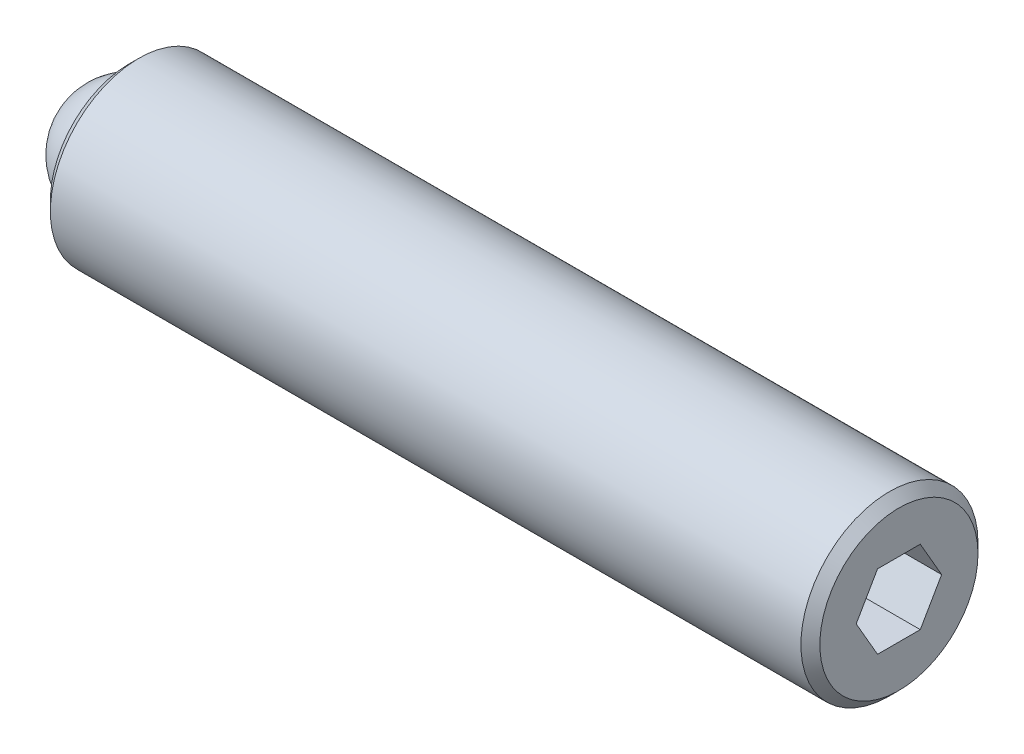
ISO-10303-21;
HEADER;
FILE_DESCRIPTION(('STEP AP214'),'2;1');
FILE_NAME('part.step','',(''),(''),'','','');
FILE_SCHEMA(('AUTOMOTIVE_DESIGN { 1 0 10303 214 1 1 1 1 }'));
ENDSEC;
DATA;
#1=APPLICATION_CONTEXT('core data for automotive mechanical design processes');
#2=APPLICATION_PROTOCOL_DEFINITION('international standard','automotive_design',2000,#1);
#3=PRODUCT_CONTEXT('',#1,'mechanical');
#4=PRODUCT('Part','Part','',(#3));
#5=PRODUCT_RELATED_PRODUCT_CATEGORY('part','',(#4));
#6=PRODUCT_DEFINITION_FORMATION('','',#4);
#7=PRODUCT_DEFINITION_CONTEXT('part definition',#1,'design');
#8=PRODUCT_DEFINITION('design','',#6,#7);
#9=PRODUCT_DEFINITION_SHAPE('','',#8);
#10=(LENGTH_UNIT() NAMED_UNIT(*) SI_UNIT(.MILLI.,.METRE.));
#11=(NAMED_UNIT(*) PLANE_ANGLE_UNIT() SI_UNIT($,.RADIAN.));
#12=(NAMED_UNIT(*) SI_UNIT($,.STERADIAN.) SOLID_ANGLE_UNIT());
#13=UNCERTAINTY_MEASURE_WITH_UNIT(LENGTH_MEASURE(1.E-05),#10,'distance_accuracy_value','');
#14=(GEOMETRIC_REPRESENTATION_CONTEXT(3) GLOBAL_UNCERTAINTY_ASSIGNED_CONTEXT((#13)) GLOBAL_UNIT_ASSIGNED_CONTEXT((#10,
#11,#12)) REPRESENTATION_CONTEXT('',''));
#15=CARTESIAN_POINT('',(0.,0.,0.));
#16=DIRECTION('',(0.,0.,1.));
#17=DIRECTION('',(1.,0.,0.));
#18=AXIS2_PLACEMENT_3D('',#15,#16,#17);
#19=CARTESIAN_POINT('',(0.,0.,0.));
#20=DIRECTION('',(0.,-1.,0.));
#21=DIRECTION('',(0.,0.,1.));
#22=AXIS2_PLACEMENT_3D('',#19,#20,#21);
#23=SPHERICAL_SURFACE('',#22,1.5875);
#24=CARTESIAN_POINT('',(0.,-1.5875,0.));
#25=VERTEX_POINT('',#24);
#26=VERTEX_LOOP('',#25);
#27=FACE_BOUND('',#26,.T.);
#28=ADVANCED_FACE('F41',(#27),#23,.T.);
#29=CLOSED_SHELL('',(#28));
#30=MANIFOLD_SOLID_BREP('B2',#29);
#31=CARTESIAN_POINT('',(20.6375,0.,0.));
#32=DIRECTION('',(-1.,0.,0.));
#33=DIRECTION('',(0.,0.,1.));
#34=AXIS2_PLACEMENT_3D('',#31,#32,#33);
#35=CYLINDRICAL_SURFACE('',#34,2.3749);
#36=CARTESIAN_POINT('',(20.3835,0.,0.));
#37=DIRECTION('',(1.,0.,0.));
#38=DIRECTION('',(0.,0.,-1.));
#39=AXIS2_PLACEMENT_3D('',#36,#37,#38);
#40=CIRCLE('',#39,2.3749);
#41=CARTESIAN_POINT('',(20.3835,0.,-2.3749));
#42=VERTEX_POINT('',#41);
#43=EDGE_CURVE('E39',#42,#42,#40,.F.);
#44=ORIENTED_EDGE('',*,*,#43,.T.);
#45=EDGE_LOOP('',(#44));
#46=FACE_BOUND('',#45,.T.);
#47=CARTESIAN_POINT('',(0.254000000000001,0.,0.));
#48=DIRECTION('',(1.,0.,0.));
#49=DIRECTION('',(0.,0.,-1.));
#50=AXIS2_PLACEMENT_3D('',#47,#48,#49);
#51=CIRCLE('',#50,2.3749);
#52=CARTESIAN_POINT('',(0.254000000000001,0.,-2.3749));
#53=VERTEX_POINT('',#52);
#54=EDGE_CURVE('E157',#53,#53,#51,.T.);
#55=ORIENTED_EDGE('',*,*,#54,.T.);
#56=EDGE_LOOP('',(#55));
#57=FACE_BOUND('',#56,.T.);
#58=ADVANCED_FACE('F54',(#46,#57),#35,.T.);
#59=CARTESIAN_POINT('',(20.6375,0.,0.));
#60=DIRECTION('',(1.,0.,0.));
#61=DIRECTION('',(0.,0.,-1.));
#62=AXIS2_PLACEMENT_3D('',#59,#60,#61);
#63=PLANE('',#62);
#64=DIRECTION('',(0.,0.866025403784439,-0.5));
#65=VECTOR('',#64,1.);
#66=CARTESIAN_POINT('',(20.6375,-0.992187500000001,-0.572839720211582));
#67=LINE('',#66,#65);
#68=CARTESIAN_POINT('',(20.6375,-0.992187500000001,-0.572839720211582));
#69=VERTEX_POINT('',#68);
#70=CARTESIAN_POINT('',(20.6375,0.,-1.14567944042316));
#71=VERTEX_POINT('',#70);
#72=EDGE_CURVE('E69',#69,#71,#67,.T.);
#73=ORIENTED_EDGE('',*,*,#72,.F.);
#74=DIRECTION('',(0.,0.,-1.));
#75=VECTOR('',#74,1.);
#76=CARTESIAN_POINT('',(20.6375,-0.992187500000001,0.572839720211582));
#77=LINE('',#76,#75);
#78=CARTESIAN_POINT('',(20.6375,-0.992187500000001,0.572839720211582));
#79=VERTEX_POINT('',#78);
#80=EDGE_CURVE('E153',#79,#69,#77,.T.);
#81=ORIENTED_EDGE('',*,*,#80,.F.);
#82=DIRECTION('',(0.,-0.866025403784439,-0.5));
#83=VECTOR('',#82,1.);
#84=CARTESIAN_POINT('',(20.6375,0.,1.14567944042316));
#85=LINE('',#84,#83);
#86=CARTESIAN_POINT('',(20.6375,0.,1.14567944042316));
#87=VERTEX_POINT('',#86);
#88=EDGE_CURVE('E151',#87,#79,#85,.T.);
#89=ORIENTED_EDGE('',*,*,#88,.F.);
#90=DIRECTION('',(0.,-0.866025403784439,0.5));
#91=VECTOR('',#90,1.);
#92=CARTESIAN_POINT('',(20.6375,0.992187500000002,0.572839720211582));
#93=LINE('',#92,#91);
#94=CARTESIAN_POINT('',(20.6375,0.992187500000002,0.572839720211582));
#95=VERTEX_POINT('',#94);
#96=EDGE_CURVE('E117',#95,#87,#93,.T.);
#97=ORIENTED_EDGE('',*,*,#96,.F.);
#98=DIRECTION('',(0.,0.,1.));
#99=VECTOR('',#98,1.);
#100=CARTESIAN_POINT('',(20.6375,0.992187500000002,-0.572839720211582));
#101=LINE('',#100,#99);
#102=CARTESIAN_POINT('',(20.6375,0.992187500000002,-0.572839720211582));
#103=VERTEX_POINT('',#102);
#104=EDGE_CURVE('E147',#103,#95,#101,.T.);
#105=ORIENTED_EDGE('',*,*,#104,.F.);
#106=DIRECTION('',(0.,0.866025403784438,0.5));
#107=VECTOR('',#106,1.);
#108=CARTESIAN_POINT('',(20.6375,0.,-1.14567944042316));
#109=LINE('',#108,#107);
#110=EDGE_CURVE('E143',#71,#103,#109,.T.);
#111=ORIENTED_EDGE('',*,*,#110,.F.);
#112=EDGE_LOOP('',(#73,#81,#89,#97,#105,#111));
#113=FACE_BOUND('',#112,.T.);
#114=CARTESIAN_POINT('',(20.6375,0.,0.));
#115=DIRECTION('',(1.,0.,0.));
#116=DIRECTION('',(0.,0.,-1.));
#117=AXIS2_PLACEMENT_3D('',#114,#115,#116);
#118=CIRCLE('',#117,2.1209);
#119=CARTESIAN_POINT('',(20.6375,0.,-2.1209));
#120=VERTEX_POINT('',#119);
#121=EDGE_CURVE('E62',#120,#120,#118,.T.);
#122=ORIENTED_EDGE('',*,*,#121,.T.);
#123=EDGE_LOOP('',(#122));
#124=FACE_BOUND('',#123,.T.);
#125=ADVANCED_FACE('F170',(#113,#124),#63,.T.);
#126=CARTESIAN_POINT('',(0.,0.,0.));
#127=DIRECTION('',(1.,0.,0.));
#128=DIRECTION('',(0.,0.,-1.));
#129=AXIS2_PLACEMENT_3D('',#126,#127,#128);
#130=PLANE('',#129);
#131=CARTESIAN_POINT('',(0.,0.,0.));
#132=DIRECTION('',(-1.,0.,0.));
#133=DIRECTION('',(0.,0.,1.));
#134=AXIS2_PLACEMENT_3D('',#131,#132,#133);
#135=CIRCLE('',#134,1.5875);
#136=CARTESIAN_POINT('',(0.,0.,1.5875));
#137=VERTEX_POINT('',#136);
#138=EDGE_CURVE('E225',#137,#137,#135,.T.);
#139=ORIENTED_EDGE('',*,*,#138,.F.);
#140=EDGE_LOOP('',(#139));
#141=FACE_BOUND('',#140,.T.);
#142=CARTESIAN_POINT('',(0.,0.,0.));
#143=DIRECTION('',(1.,0.,0.));
#144=DIRECTION('',(0.,0.,-1.));
#145=AXIS2_PLACEMENT_3D('',#142,#143,#144);
#146=CIRCLE('',#145,2.1209);
#147=CARTESIAN_POINT('',(0.,0.,-2.1209));
#148=VERTEX_POINT('',#147);
#149=EDGE_CURVE('E165',#148,#148,#146,.F.);
#150=ORIENTED_EDGE('',*,*,#149,.T.);
#151=EDGE_LOOP('',(#150));
#152=FACE_BOUND('',#151,.T.);
#153=ADVANCED_FACE('F182',(#141,#152),#130,.F.);
#154=CARTESIAN_POINT('',(0.254000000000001,0.,0.));
#155=DIRECTION('',(1.,0.,0.));
#156=DIRECTION('',(0.,0.,-1.));
#157=AXIS2_PLACEMENT_3D('',#154,#155,#156);
#158=CONICAL_SURFACE('',#157,2.3749,0.785398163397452);
#159=ORIENTED_EDGE('',*,*,#149,.F.);
#160=EDGE_LOOP('',(#159));
#161=FACE_BOUND('',#160,.T.);
#162=ORIENTED_EDGE('',*,*,#54,.F.);
#163=EDGE_LOOP('',(#162));
#164=FACE_BOUND('',#163,.T.);
#165=ADVANCED_FACE('F174',(#161,#164),#158,.T.);
#166=CARTESIAN_POINT('',(20.6375,0.,0.));
#167=DIRECTION('',(-1.,0.,0.));
#168=DIRECTION('',(0.,0.,1.));
#169=AXIS2_PLACEMENT_3D('',#166,#167,#168);
#170=CONICAL_SURFACE('',#169,2.1209,0.785398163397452);
#171=ORIENTED_EDGE('',*,*,#43,.F.);
#172=EDGE_LOOP('',(#171));
#173=FACE_BOUND('',#172,.T.);
#174=ORIENTED_EDGE('',*,*,#121,.F.);
#175=EDGE_LOOP('',(#174));
#176=FACE_BOUND('',#175,.T.);
#177=ADVANCED_FACE('F56',(#173,#176),#170,.T.);
#178=CARTESIAN_POINT('',(18.3515,-0.992187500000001,-0.572839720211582));
#179=DIRECTION('',(0.,-0.5,-0.866025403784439));
#180=DIRECTION('',(0.,0.866025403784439,-0.5));
#181=AXIS2_PLACEMENT_3D('',#178,#179,#180);
#182=PLANE('',#181);
#183=ORIENTED_EDGE('',*,*,#72,.T.);
#184=DIRECTION('',(1.,0.,0.));
#185=VECTOR('',#184,1.);
#186=CARTESIAN_POINT('',(18.3515,0.,-1.14567944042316));
#187=LINE('',#186,#185);
#188=CARTESIAN_POINT('',(18.3515,0.,-1.14567944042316));
#189=VERTEX_POINT('',#188);
#190=EDGE_CURVE('E99',#189,#71,#187,.T.);
#191=ORIENTED_EDGE('',*,*,#190,.F.);
#192=DIRECTION('',(0.,0.866025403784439,-0.5));
#193=VECTOR('',#192,1.);
#194=CARTESIAN_POINT('',(18.3515,-0.992187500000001,-0.572839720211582));
#195=LINE('',#194,#193);
#196=CARTESIAN_POINT('',(18.3515,-0.992187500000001,-0.572839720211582));
#197=VERTEX_POINT('',#196);
#198=EDGE_CURVE('E155',#197,#189,#195,.T.);
#199=ORIENTED_EDGE('',*,*,#198,.F.);
#200=DIRECTION('',(1.,0.,0.));
#201=VECTOR('',#200,1.);
#202=CARTESIAN_POINT('',(18.3515,-0.992187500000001,-0.572839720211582));
#203=LINE('',#202,#201);
#204=EDGE_CURVE('E77',#197,#69,#203,.T.);
#205=ORIENTED_EDGE('',*,*,#204,.T.);
#206=EDGE_LOOP('',(#183,#191,#199,#205));
#207=FACE_BOUND('',#206,.T.);
#208=ADVANCED_FACE('F173',(#207),#182,.F.);
#209=CARTESIAN_POINT('',(18.3515,-0.992187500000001,0.572839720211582));
#210=DIRECTION('',(0.,-1.,0.));
#211=DIRECTION('',(0.,0.,-1.));
#212=AXIS2_PLACEMENT_3D('',#209,#210,#211);
#213=PLANE('',#212);
#214=ORIENTED_EDGE('',*,*,#80,.T.);
#215=ORIENTED_EDGE('',*,*,#204,.F.);
#216=DIRECTION('',(0.,0.,-1.));
#217=VECTOR('',#216,1.);
#218=CARTESIAN_POINT('',(18.3515,-0.992187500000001,0.572839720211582));
#219=LINE('',#218,#217);
#220=CARTESIAN_POINT('',(18.3515,-0.992187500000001,0.572839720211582));
#221=VERTEX_POINT('',#220);
#222=EDGE_CURVE('E129',#221,#197,#219,.T.);
#223=ORIENTED_EDGE('',*,*,#222,.F.);
#224=DIRECTION('',(1.,0.,0.));
#225=VECTOR('',#224,1.);
#226=CARTESIAN_POINT('',(18.3515,-0.992187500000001,0.572839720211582));
#227=LINE('',#226,#225);
#228=EDGE_CURVE('E121',#221,#79,#227,.T.);
#229=ORIENTED_EDGE('',*,*,#228,.T.);
#230=EDGE_LOOP('',(#214,#215,#223,#229));
#231=FACE_BOUND('',#230,.T.);
#232=ADVANCED_FACE('F180',(#231),#213,.F.);
#233=CARTESIAN_POINT('',(18.3515,0.,1.14567944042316));
#234=DIRECTION('',(0.,-0.5,0.866025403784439));
#235=DIRECTION('',(0.,-0.866025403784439,-0.5));
#236=AXIS2_PLACEMENT_3D('',#233,#234,#235);
#237=PLANE('',#236);
#238=ORIENTED_EDGE('',*,*,#88,.T.);
#239=ORIENTED_EDGE('',*,*,#228,.F.);
#240=DIRECTION('',(0.,-0.866025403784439,-0.5));
#241=VECTOR('',#240,1.);
#242=CARTESIAN_POINT('',(18.3515,0.,1.14567944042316));
#243=LINE('',#242,#241);
#244=CARTESIAN_POINT('',(18.3515,0.,1.14567944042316));
#245=VERTEX_POINT('',#244);
#246=EDGE_CURVE('E125',#245,#221,#243,.T.);
#247=ORIENTED_EDGE('',*,*,#246,.F.);
#248=DIRECTION('',(1.,0.,0.));
#249=VECTOR('',#248,1.);
#250=CARTESIAN_POINT('',(18.3515,0.,1.14567944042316));
#251=LINE('',#250,#249);
#252=EDGE_CURVE('E110',#245,#87,#251,.T.);
#253=ORIENTED_EDGE('',*,*,#252,.T.);
#254=EDGE_LOOP('',(#238,#239,#247,#253));
#255=FACE_BOUND('',#254,.T.);
#256=ADVANCED_FACE('F126',(#255),#237,.F.);
#257=CARTESIAN_POINT('',(18.3515,0.992187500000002,0.572839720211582));
#258=DIRECTION('',(0.,0.5,0.866025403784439));
#259=DIRECTION('',(0.,-0.866025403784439,0.5));
#260=AXIS2_PLACEMENT_3D('',#257,#258,#259);
#261=PLANE('',#260);
#262=ORIENTED_EDGE('',*,*,#96,.T.);
#263=ORIENTED_EDGE('',*,*,#252,.F.);
#264=DIRECTION('',(0.,-0.866025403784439,0.5));
#265=VECTOR('',#264,1.);
#266=CARTESIAN_POINT('',(18.3515,0.992187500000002,0.572839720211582));
#267=LINE('',#266,#265);
#268=CARTESIAN_POINT('',(18.3515,0.992187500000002,0.572839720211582));
#269=VERTEX_POINT('',#268);
#270=EDGE_CURVE('E114',#269,#245,#267,.T.);
#271=ORIENTED_EDGE('',*,*,#270,.F.);
#272=DIRECTION('',(1.,0.,0.));
#273=VECTOR('',#272,1.);
#274=CARTESIAN_POINT('',(18.3515,0.992187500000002,0.572839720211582));
#275=LINE('',#274,#273);
#276=EDGE_CURVE('E122',#269,#95,#275,.T.);
#277=ORIENTED_EDGE('',*,*,#276,.T.);
#278=EDGE_LOOP('',(#262,#263,#271,#277));
#279=FACE_BOUND('',#278,.T.);
#280=ADVANCED_FACE('F112',(#279),#261,.F.);
#281=CARTESIAN_POINT('',(18.3515,0.992187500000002,-0.572839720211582));
#282=DIRECTION('',(0.,1.,0.));
#283=DIRECTION('',(0.,0.,1.));
#284=AXIS2_PLACEMENT_3D('',#281,#282,#283);
#285=PLANE('',#284);
#286=ORIENTED_EDGE('',*,*,#104,.T.);
#287=ORIENTED_EDGE('',*,*,#276,.F.);
#288=DIRECTION('',(0.,0.,1.));
#289=VECTOR('',#288,1.);
#290=CARTESIAN_POINT('',(18.3515,0.992187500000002,-0.572839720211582));
#291=LINE('',#290,#289);
#292=CARTESIAN_POINT('',(18.3515,0.992187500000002,-0.572839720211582));
#293=VERTEX_POINT('',#292);
#294=EDGE_CURVE('E135',#293,#269,#291,.T.);
#295=ORIENTED_EDGE('',*,*,#294,.F.);
#296=DIRECTION('',(1.,0.,0.));
#297=VECTOR('',#296,1.);
#298=CARTESIAN_POINT('',(18.3515,0.992187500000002,-0.572839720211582));
#299=LINE('',#298,#297);
#300=EDGE_CURVE('E160',#293,#103,#299,.T.);
#301=ORIENTED_EDGE('',*,*,#300,.T.);
#302=EDGE_LOOP('',(#286,#287,#295,#301));
#303=FACE_BOUND('',#302,.T.);
#304=ADVANCED_FACE('F201',(#303),#285,.F.);
#305=CARTESIAN_POINT('',(18.3515,0.,-1.14567944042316));
#306=DIRECTION('',(0.,0.5,-0.866025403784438));
#307=DIRECTION('',(0.,0.866025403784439,0.5));
#308=AXIS2_PLACEMENT_3D('',#305,#306,#307);
#309=PLANE('',#308);
#310=ORIENTED_EDGE('',*,*,#110,.T.);
#311=ORIENTED_EDGE('',*,*,#300,.F.);
#312=DIRECTION('',(0.,0.866025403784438,0.5));
#313=VECTOR('',#312,1.);
#314=CARTESIAN_POINT('',(18.3515,0.,-1.14567944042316));
#315=LINE('',#314,#313);
#316=EDGE_CURVE('E137',#189,#293,#315,.T.);
#317=ORIENTED_EDGE('',*,*,#316,.F.);
#318=ORIENTED_EDGE('',*,*,#190,.T.);
#319=EDGE_LOOP('',(#310,#311,#317,#318));
#320=FACE_BOUND('',#319,.T.);
#321=ADVANCED_FACE('F198',(#320),#309,.F.);
#322=CARTESIAN_POINT('',(18.3515,0.,0.));
#323=DIRECTION('',(1.,0.,0.));
#324=DIRECTION('',(0.,0.,-1.));
#325=AXIS2_PLACEMENT_3D('',#322,#323,#324);
#326=PLANE('',#325);
#327=ORIENTED_EDGE('',*,*,#198,.T.);
#328=ORIENTED_EDGE('',*,*,#316,.T.);
#329=ORIENTED_EDGE('',*,*,#294,.T.);
#330=ORIENTED_EDGE('',*,*,#270,.T.);
#331=ORIENTED_EDGE('',*,*,#246,.T.);
#332=ORIENTED_EDGE('',*,*,#222,.T.);
#333=EDGE_LOOP('',(#327,#328,#329,#330,#331,#332));
#334=FACE_BOUND('',#333,.T.);
#335=ADVANCED_FACE('F132',(#334),#326,.T.);
#336=CARTESIAN_POINT('',(1.5875,0.,0.));
#337=DIRECTION('',(-1.,0.,0.));
#338=DIRECTION('',(0.,0.,1.));
#339=AXIS2_PLACEMENT_3D('',#336,#337,#338);
#340=CYLINDRICAL_SURFACE('',#339,1.5875);
#341=CARTESIAN_POINT('',(1.5875,0.,0.));
#342=DIRECTION('',(-1.,0.,0.));
#343=DIRECTION('',(0.,0.,1.));
#344=AXIS2_PLACEMENT_3D('',#341,#342,#343);
#345=CIRCLE('',#344,1.5875);
#346=CARTESIAN_POINT('',(1.5875,0.,1.5875));
#347=VERTEX_POINT('',#346);
#348=EDGE_CURVE('E144',#347,#347,#345,.T.);
#349=ORIENTED_EDGE('',*,*,#348,.F.);
#350=EDGE_LOOP('',(#349));
#351=FACE_BOUND('',#350,.T.);
#352=ORIENTED_EDGE('',*,*,#138,.T.);
#353=EDGE_LOOP('',(#352));
#354=FACE_BOUND('',#353,.T.);
#355=ADVANCED_FACE('F214',(#351,#354),#340,.F.);
#356=CARTESIAN_POINT('',(1.5875,0.,0.));
#357=DIRECTION('',(-1.,0.,0.));
#358=DIRECTION('',(0.,0.,1.));
#359=AXIS2_PLACEMENT_3D('',#356,#357,#358);
#360=PLANE('',#359);
#361=ORIENTED_EDGE('',*,*,#348,.T.);
#362=EDGE_LOOP('',(#361));
#363=FACE_BOUND('',#362,.T.);
#364=ADVANCED_FACE('F217',(#363),#360,.T.);
#365=CLOSED_SHELL('',(#58,#125,#153,#165,#177,#208,#232,#256,#280,#304,#321,#335,#355,#364));
#366=MANIFOLD_SOLID_BREP('B6',#365);
#367=ADVANCED_BREP_SHAPE_REPRESENTATION('',(#18,#30,#366),#14);
#368=SHAPE_DEFINITION_REPRESENTATION(#9,#367);
ENDSEC;
END-ISO-10303-21;
